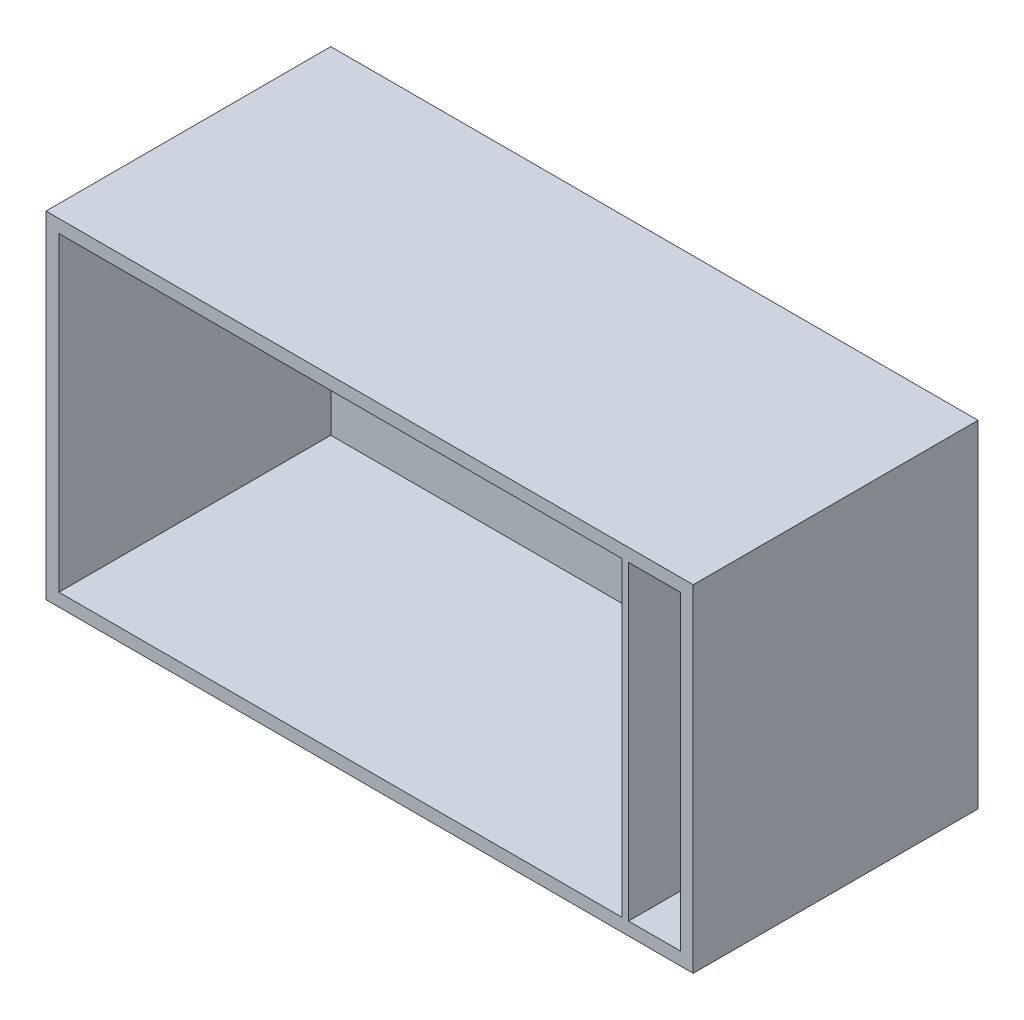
from build123d import *

# Parameters (mm, degrees)
SKETCH1_W      = 635
SKETCH1_H      = 330.2
SKETCH1_W_2    = 609.6
SKETCH1_H_2    = 304.8
EXTRUDE1_DEPTH = 266.7
SKETCH2_W      = 635
SKETCH2_H      = 330.2
EXTRUDE2_DEPTH = 12.7
SKETCH3_W      = 6.35
SKETCH3_H      = 304.8
EXTRUDE3_DEPTH = 266.7


with BuildPart() as part:
    # Sketch1 → Extrude1 (new body)
    with BuildSketch(Plane.XY):
        with Locations((304.8, 152.4)):
            Rectangle(SKETCH1_W, SKETCH1_H)
        with Locations((304.8, 152.4)):
            Rectangle(SKETCH1_W_2, SKETCH1_H_2, mode=Mode.SUBTRACT)
    extrude(amount=EXTRUDE1_DEPTH)

    # Sketch2 → Extrude2 (add)
    with BuildSketch(Plane(origin=(0, 0, 0), x_dir=(-1, 0, 0), z_dir=(0, 0, -1))):
        with Locations((-304.8, 152.4)):
            Rectangle(SKETCH2_W, SKETCH2_H)
    extrude(amount=EXTRUDE2_DEPTH)

    # Sketch3 → Extrude3 (add)
    with BuildSketch(Plane.XY):
        with Locations((555.625, 152.4)):
            Rectangle(SKETCH3_W, SKETCH3_H)
    extrude(amount=EXTRUDE3_DEPTH)


solid = part.part
